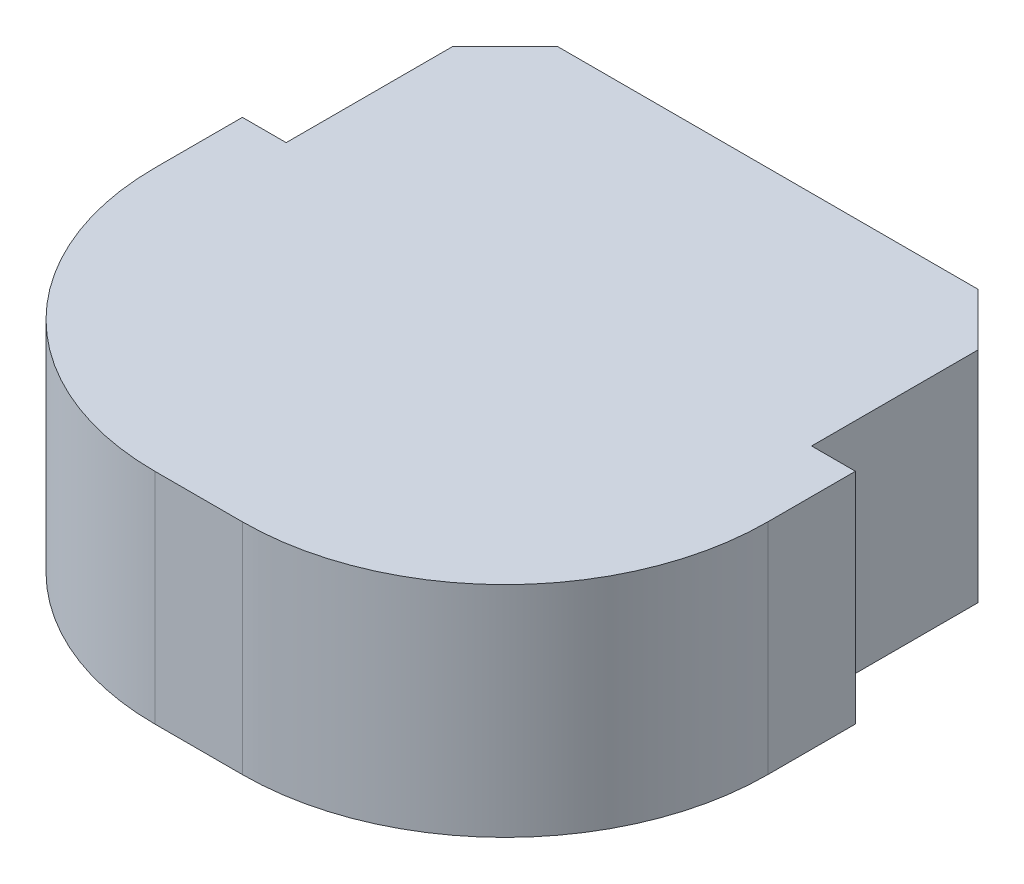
ISO-10303-21;
HEADER;
FILE_DESCRIPTION(('STEP AP214'),'2;1');
FILE_NAME('part.step','',(''),(''),'','','');
FILE_SCHEMA(('AUTOMOTIVE_DESIGN { 1 0 10303 214 1 1 1 1 }'));
ENDSEC;
DATA;
#1=APPLICATION_CONTEXT('core data for automotive mechanical design processes');
#2=APPLICATION_PROTOCOL_DEFINITION('international standard','automotive_design',2000,#1);
#3=PRODUCT_CONTEXT('',#1,'mechanical');
#4=PRODUCT('Part','Part','',(#3));
#5=PRODUCT_RELATED_PRODUCT_CATEGORY('part','',(#4));
#6=PRODUCT_DEFINITION_FORMATION('','',#4);
#7=PRODUCT_DEFINITION_CONTEXT('part definition',#1,'design');
#8=PRODUCT_DEFINITION('design','',#6,#7);
#9=PRODUCT_DEFINITION_SHAPE('','',#8);
#10=(LENGTH_UNIT() NAMED_UNIT(*) SI_UNIT(.MILLI.,.METRE.));
#11=(NAMED_UNIT(*) PLANE_ANGLE_UNIT() SI_UNIT($,.RADIAN.));
#12=(NAMED_UNIT(*) SI_UNIT($,.STERADIAN.) SOLID_ANGLE_UNIT());
#13=UNCERTAINTY_MEASURE_WITH_UNIT(LENGTH_MEASURE(1.E-05),#10,'distance_accuracy_value','');
#14=(GEOMETRIC_REPRESENTATION_CONTEXT(3) GLOBAL_UNCERTAINTY_ASSIGNED_CONTEXT((#13)) GLOBAL_UNIT_ASSIGNED_CONTEXT((#10,
#11,#12)) REPRESENTATION_CONTEXT('',''));
#15=CARTESIAN_POINT('',(0.,0.,0.));
#16=DIRECTION('',(0.,0.,1.));
#17=DIRECTION('',(1.,0.,0.));
#18=AXIS2_PLACEMENT_3D('',#15,#16,#17);
#19=CARTESIAN_POINT('',(-4.445,3.175,-2.54));
#20=DIRECTION('',(0.,0.,1.));
#21=DIRECTION('',(1.,0.,0.));
#22=AXIS2_PLACEMENT_3D('',#19,#20,#21);
#23=PLANE('',#22);
#24=DIRECTION('',(0.,1.,0.));
#25=VECTOR('',#24,1.);
#26=CARTESIAN_POINT('',(-3.81,3.175,-2.54));
#27=LINE('',#26,#25);
#28=CARTESIAN_POINT('',(-3.81,0.,-2.54));
#29=VERTEX_POINT('',#28);
#30=CARTESIAN_POINT('',(-3.81,3.175,-2.54));
#31=VERTEX_POINT('',#30);
#32=EDGE_CURVE('E168',#29,#31,#27,.T.);
#33=ORIENTED_EDGE('',*,*,#32,.F.);
#34=DIRECTION('',(-1.,0.,0.));
#35=VECTOR('',#34,1.);
#36=CARTESIAN_POINT('',(-4.445,0.,-2.54));
#37=LINE('',#36,#35);
#38=CARTESIAN_POINT('',(-4.445,0.,-2.54));
#39=VERTEX_POINT('',#38);
#40=EDGE_CURVE('E162',#29,#39,#37,.T.);
#41=ORIENTED_EDGE('',*,*,#40,.T.);
#42=DIRECTION('',(0.,-1.,0.));
#43=VECTOR('',#42,1.);
#44=CARTESIAN_POINT('',(-4.445,3.175,-2.54));
#45=LINE('',#44,#43);
#46=CARTESIAN_POINT('',(-4.445,3.175,-2.54));
#47=VERTEX_POINT('',#46);
#48=EDGE_CURVE('E201',#47,#39,#45,.T.);
#49=ORIENTED_EDGE('',*,*,#48,.F.);
#50=DIRECTION('',(-1.,0.,0.));
#51=VECTOR('',#50,1.);
#52=CARTESIAN_POINT('',(-4.445,3.175,-2.54));
#53=LINE('',#52,#51);
#54=EDGE_CURVE('E190',#31,#47,#53,.T.);
#55=ORIENTED_EDGE('',*,*,#54,.F.);
#56=EDGE_LOOP('',(#33,#41,#49,#55));
#57=FACE_BOUND('',#56,.T.);
#58=ADVANCED_FACE('F43',(#57),#23,.F.);
#59=DIRECTION('',(0.,-1.,0.));
#60=VECTOR('',#59,1.);
#61=CARTESIAN_POINT('',(3.81,3.175,-2.54));
#62=LINE('',#61,#60);
#63=CARTESIAN_POINT('',(3.81,3.175,-2.54));
#64=VERTEX_POINT('',#63);
#65=CARTESIAN_POINT('',(3.81,0.,-2.54));
#66=VERTEX_POINT('',#65);
#67=EDGE_CURVE('E156',#64,#66,#62,.T.);
#68=ORIENTED_EDGE('',*,*,#67,.F.);
#69=CARTESIAN_POINT('',(4.445,3.175,-2.54));
#70=VERTEX_POINT('',#69);
#71=EDGE_CURVE('E192',#70,#64,#53,.T.);
#72=ORIENTED_EDGE('',*,*,#71,.F.);
#73=DIRECTION('',(0.,-1.,0.));
#74=VECTOR('',#73,1.);
#75=CARTESIAN_POINT('',(4.445,3.175,-2.54));
#76=LINE('',#75,#74);
#77=CARTESIAN_POINT('',(4.445,0.,-2.54));
#78=VERTEX_POINT('',#77);
#79=EDGE_CURVE('E159',#70,#78,#76,.T.);
#80=ORIENTED_EDGE('',*,*,#79,.T.);
#81=EDGE_CURVE('E141',#78,#66,#37,.T.);
#82=ORIENTED_EDGE('',*,*,#81,.T.);
#83=EDGE_LOOP('',(#68,#72,#80,#82));
#84=FACE_BOUND('',#83,.T.);
#85=ADVANCED_FACE('F154',(#84),#23,.F.);
#86=CARTESIAN_POINT('',(4.445,3.175,-2.54));
#87=DIRECTION('',(-1.,0.,0.));
#88=DIRECTION('',(0.,0.,1.));
#89=AXIS2_PLACEMENT_3D('',#86,#87,#88);
#90=PLANE('',#89);
#91=DIRECTION('',(0.,0.,-1.));
#92=VECTOR('',#91,1.);
#93=CARTESIAN_POINT('',(4.445,3.175,-2.54));
#94=LINE('',#93,#92);
#95=CARTESIAN_POINT('',(4.445,3.175,-1.27));
#96=VERTEX_POINT('',#95);
#97=EDGE_CURVE('E187',#96,#70,#94,.T.);
#98=ORIENTED_EDGE('',*,*,#97,.F.);
#99=DIRECTION('',(0.,-1.,0.));
#100=VECTOR('',#99,1.);
#101=CARTESIAN_POINT('',(4.445,3.175,-1.27));
#102=LINE('',#101,#100);
#103=CARTESIAN_POINT('',(4.445,0.,-1.27));
#104=VERTEX_POINT('',#103);
#105=EDGE_CURVE('E11',#96,#104,#102,.T.);
#106=ORIENTED_EDGE('',*,*,#105,.T.);
#107=DIRECTION('',(0.,0.,-1.));
#108=VECTOR('',#107,1.);
#109=CARTESIAN_POINT('',(4.445,0.,-2.54));
#110=LINE('',#109,#108);
#111=EDGE_CURVE('E186',#104,#78,#110,.T.);
#112=ORIENTED_EDGE('',*,*,#111,.T.);
#113=ORIENTED_EDGE('',*,*,#79,.F.);
#114=EDGE_LOOP('',(#98,#106,#112,#113));
#115=FACE_BOUND('',#114,.T.);
#116=ADVANCED_FACE('F302',(#115),#90,.F.);
#117=CARTESIAN_POINT('',(-4.445,3.175,-2.54));
#118=DIRECTION('',(1.,0.,0.));
#119=DIRECTION('',(0.,0.,-1.));
#120=AXIS2_PLACEMENT_3D('',#117,#118,#119);
#121=PLANE('',#120);
#122=DIRECTION('',(0.,0.,1.));
#123=VECTOR('',#122,1.);
#124=CARTESIAN_POINT('',(-4.445,0.,-2.54));
#125=LINE('',#124,#123);
#126=CARTESIAN_POINT('',(-4.445,0.,-1.27));
#127=VERTEX_POINT('',#126);
#128=EDGE_CURVE('E161',#39,#127,#125,.T.);
#129=ORIENTED_EDGE('',*,*,#128,.T.);
#130=DIRECTION('',(0.,-1.,0.));
#131=VECTOR('',#130,1.);
#132=CARTESIAN_POINT('',(-4.445,3.175,-1.27));
#133=LINE('',#132,#131);
#134=CARTESIAN_POINT('',(-4.445,3.175,-1.27));
#135=VERTEX_POINT('',#134);
#136=EDGE_CURVE('E67',#127,#135,#133,.F.);
#137=ORIENTED_EDGE('',*,*,#136,.T.);
#138=DIRECTION('',(0.,0.,1.));
#139=VECTOR('',#138,1.);
#140=CARTESIAN_POINT('',(-4.445,3.175,-2.54));
#141=LINE('',#140,#139);
#142=EDGE_CURVE('E195',#47,#135,#141,.T.);
#143=ORIENTED_EDGE('',*,*,#142,.F.);
#144=ORIENTED_EDGE('',*,*,#48,.T.);
#145=EDGE_LOOP('',(#129,#137,#143,#144));
#146=FACE_BOUND('',#145,.T.);
#147=ADVANCED_FACE('F267',(#146),#121,.F.);
#148=CARTESIAN_POINT('',(-4.445,3.175,2.54));
#149=DIRECTION('',(0.,0.,-1.));
#150=DIRECTION('',(-1.,0.,0.));
#151=AXIS2_PLACEMENT_3D('',#148,#149,#150);
#152=PLANE('',#151);
#153=DIRECTION('',(1.,0.,0.));
#154=VECTOR('',#153,1.);
#155=CARTESIAN_POINT('',(-4.445,3.175,2.54));
#156=LINE('',#155,#154);
#157=CARTESIAN_POINT('',(-0.634999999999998,3.175,2.54));
#158=VERTEX_POINT('',#157);
#159=CARTESIAN_POINT('',(0.635000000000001,3.175,2.54));
#160=VERTEX_POINT('',#159);
#161=EDGE_CURVE('E198',#158,#160,#156,.T.);
#162=ORIENTED_EDGE('',*,*,#161,.F.);
#163=DIRECTION('',(0.,-1.,0.));
#164=VECTOR('',#163,1.);
#165=CARTESIAN_POINT('',(-0.634999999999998,3.175,2.54));
#166=LINE('',#165,#164);
#167=CARTESIAN_POINT('',(-0.634999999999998,0.,2.54));
#168=VERTEX_POINT('',#167);
#169=EDGE_CURVE('E242',#158,#168,#166,.T.);
#170=ORIENTED_EDGE('',*,*,#169,.T.);
#171=DIRECTION('',(1.,0.,0.));
#172=VECTOR('',#171,1.);
#173=CARTESIAN_POINT('',(-4.445,0.,2.54));
#174=LINE('',#173,#172);
#175=CARTESIAN_POINT('',(0.635000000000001,0.,2.54));
#176=VERTEX_POINT('',#175);
#177=EDGE_CURVE('E191',#168,#176,#174,.T.);
#178=ORIENTED_EDGE('',*,*,#177,.T.);
#179=DIRECTION('',(0.,-1.,0.));
#180=VECTOR('',#179,1.);
#181=CARTESIAN_POINT('',(0.635000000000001,3.175,2.54));
#182=LINE('',#181,#180);
#183=EDGE_CURVE('E239',#176,#160,#182,.F.);
#184=ORIENTED_EDGE('',*,*,#183,.T.);
#185=EDGE_LOOP('',(#162,#170,#178,#184));
#186=FACE_BOUND('',#185,.T.);
#187=ADVANCED_FACE('F262',(#186),#152,.F.);
#188=CARTESIAN_POINT('',(0.,3.175,0.));
#189=DIRECTION('',(0.,1.,0.));
#190=DIRECTION('',(0.,0.,1.));
#191=AXIS2_PLACEMENT_3D('',#188,#189,#190);
#192=PLANE('',#191);
#193=ORIENTED_EDGE('',*,*,#142,.T.);
#194=CARTESIAN_POINT('',(-0.634999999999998,3.175,-1.27));
#195=DIRECTION('',(0.,1.,0.));
#196=DIRECTION('',(0.,0.,1.));
#197=AXIS2_PLACEMENT_3D('',#194,#195,#196);
#198=CIRCLE('',#197,3.81);
#199=EDGE_CURVE('E52',#135,#158,#198,.T.);
#200=ORIENTED_EDGE('',*,*,#199,.T.);
#201=ORIENTED_EDGE('',*,*,#161,.T.);
#202=CARTESIAN_POINT('',(0.635000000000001,3.175,-1.27));
#203=DIRECTION('',(0.,1.,0.));
#204=DIRECTION('',(0.,0.,1.));
#205=AXIS2_PLACEMENT_3D('',#202,#203,#204);
#206=CIRCLE('',#205,3.81);
#207=EDGE_CURVE('E59',#160,#96,#206,.T.);
#208=ORIENTED_EDGE('',*,*,#207,.T.);
#209=ORIENTED_EDGE('',*,*,#97,.T.);
#210=ORIENTED_EDGE('',*,*,#71,.T.);
#211=DIRECTION('',(0.,0.,1.));
#212=VECTOR('',#211,1.);
#213=CARTESIAN_POINT('',(3.81,3.175,-5.715));
#214=LINE('',#213,#212);
#215=CARTESIAN_POINT('',(3.81,3.175,-4.953));
#216=VERTEX_POINT('',#215);
#217=EDGE_CURVE('E149',#216,#64,#214,.T.);
#218=ORIENTED_EDGE('',*,*,#217,.F.);
#219=DIRECTION('',(-0.707106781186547,0.,-0.707106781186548));
#220=VECTOR('',#219,1.);
#221=CARTESIAN_POINT('',(4.3815,3.175,-4.3815));
#222=LINE('',#221,#220);
#223=CARTESIAN_POINT('',(3.048,3.175,-5.715));
#224=VERTEX_POINT('',#223);
#225=EDGE_CURVE('E222',#216,#224,#222,.T.);
#226=ORIENTED_EDGE('',*,*,#225,.T.);
#227=DIRECTION('',(1.,0.,0.));
#228=VECTOR('',#227,1.);
#229=CARTESIAN_POINT('',(3.81,3.175,-5.715));
#230=LINE('',#229,#228);
#231=CARTESIAN_POINT('',(-3.048,3.175,-5.715));
#232=VERTEX_POINT('',#231);
#233=EDGE_CURVE('E167',#232,#224,#230,.T.);
#234=ORIENTED_EDGE('',*,*,#233,.F.);
#235=DIRECTION('',(-0.707106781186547,0.,0.707106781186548));
#236=VECTOR('',#235,1.);
#237=CARTESIAN_POINT('',(-4.3815,3.175,-4.38149999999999));
#238=LINE('',#237,#236);
#239=CARTESIAN_POINT('',(-3.81,3.175,-4.953));
#240=VERTEX_POINT('',#239);
#241=EDGE_CURVE('E225',#232,#240,#238,.T.);
#242=ORIENTED_EDGE('',*,*,#241,.T.);
#243=DIRECTION('',(0.,0.,1.));
#244=VECTOR('',#243,1.);
#245=CARTESIAN_POINT('',(-3.81,3.175,-5.715));
#246=LINE('',#245,#244);
#247=EDGE_CURVE('E183',#240,#31,#246,.T.);
#248=ORIENTED_EDGE('',*,*,#247,.T.);
#249=ORIENTED_EDGE('',*,*,#54,.T.);
#250=EDGE_LOOP('',(#193,#200,#201,#208,#209,#210,#218,#226,#234,#242,#248,#249));
#251=FACE_BOUND('',#250,.T.);
#252=ADVANCED_FACE('F258',(#251),#192,.T.);
#253=CARTESIAN_POINT('',(0.,0.,0.));
#254=DIRECTION('',(0.,1.,0.));
#255=DIRECTION('',(0.,0.,1.));
#256=AXIS2_PLACEMENT_3D('',#253,#254,#255);
#257=PLANE('',#256);
#258=ORIENTED_EDGE('',*,*,#177,.F.);
#259=CARTESIAN_POINT('',(-0.634999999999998,0.,-1.27));
#260=DIRECTION('',(0.,1.,0.));
#261=DIRECTION('',(0.,0.,1.));
#262=AXIS2_PLACEMENT_3D('',#259,#260,#261);
#263=CIRCLE('',#262,3.81);
#264=EDGE_CURVE('E249',#168,#127,#263,.F.);
#265=ORIENTED_EDGE('',*,*,#264,.T.);
#266=ORIENTED_EDGE('',*,*,#128,.F.);
#267=ORIENTED_EDGE('',*,*,#40,.F.);
#268=DIRECTION('',(0.,0.,1.));
#269=VECTOR('',#268,1.);
#270=CARTESIAN_POINT('',(-3.81,0.,-5.715));
#271=LINE('',#270,#269);
#272=CARTESIAN_POINT('',(-3.81,0.,-4.953));
#273=VERTEX_POINT('',#272);
#274=EDGE_CURVE('E150',#273,#29,#271,.T.);
#275=ORIENTED_EDGE('',*,*,#274,.F.);
#276=DIRECTION('',(0.707106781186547,0.,-0.707106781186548));
#277=VECTOR('',#276,1.);
#278=CARTESIAN_POINT('',(-3.048,0.,-5.715));
#279=LINE('',#278,#277);
#280=CARTESIAN_POINT('',(-3.048,0.,-5.715));
#281=VERTEX_POINT('',#280);
#282=EDGE_CURVE('E233',#273,#281,#279,.T.);
#283=ORIENTED_EDGE('',*,*,#282,.T.);
#284=DIRECTION('',(-1.,0.,0.));
#285=VECTOR('',#284,1.);
#286=CARTESIAN_POINT('',(3.81,0.,-5.715));
#287=LINE('',#286,#285);
#288=CARTESIAN_POINT('',(3.048,0.,-5.715));
#289=VERTEX_POINT('',#288);
#290=EDGE_CURVE('E173',#289,#281,#287,.T.);
#291=ORIENTED_EDGE('',*,*,#290,.F.);
#292=DIRECTION('',(0.707106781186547,0.,0.707106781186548));
#293=VECTOR('',#292,1.);
#294=CARTESIAN_POINT('',(3.048,0.,-5.715));
#295=LINE('',#294,#293);
#296=CARTESIAN_POINT('',(3.81,0.,-4.953));
#297=VERTEX_POINT('',#296);
#298=EDGE_CURVE('E144',#289,#297,#295,.T.);
#299=ORIENTED_EDGE('',*,*,#298,.T.);
#300=DIRECTION('',(0.,0.,1.));
#301=VECTOR('',#300,1.);
#302=CARTESIAN_POINT('',(3.81,0.,-5.715));
#303=LINE('',#302,#301);
#304=EDGE_CURVE('E136',#297,#66,#303,.T.);
#305=ORIENTED_EDGE('',*,*,#304,.T.);
#306=ORIENTED_EDGE('',*,*,#81,.F.);
#307=ORIENTED_EDGE('',*,*,#111,.F.);
#308=CARTESIAN_POINT('',(0.635000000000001,0.,-1.27));
#309=DIRECTION('',(0.,1.,0.));
#310=DIRECTION('',(0.,0.,1.));
#311=AXIS2_PLACEMENT_3D('',#308,#309,#310);
#312=CIRCLE('',#311,3.81);
#313=EDGE_CURVE('E246',#104,#176,#312,.F.);
#314=ORIENTED_EDGE('',*,*,#313,.T.);
#315=EDGE_LOOP('',(#258,#265,#266,#267,#275,#283,#291,#299,#305,#306,#307,#314));
#316=FACE_BOUND('',#315,.T.);
#317=ADVANCED_FACE('F139',(#316),#257,.F.);
#318=CARTESIAN_POINT('',(-3.81,3.175,-5.715));
#319=DIRECTION('',(1.,0.,0.));
#320=DIRECTION('',(0.,1.,0.));
#321=AXIS2_PLACEMENT_3D('',#318,#319,#320);
#322=PLANE('',#321);
#323=ORIENTED_EDGE('',*,*,#247,.F.);
#324=DIRECTION('',(0.,-1.,0.));
#325=VECTOR('',#324,1.);
#326=CARTESIAN_POINT('',(-3.81,0.,-4.953));
#327=LINE('',#326,#325);
#328=EDGE_CURVE('E228',#240,#273,#327,.T.);
#329=ORIENTED_EDGE('',*,*,#328,.T.);
#330=ORIENTED_EDGE('',*,*,#274,.T.);
#331=ORIENTED_EDGE('',*,*,#32,.T.);
#332=EDGE_LOOP('',(#323,#329,#330,#331));
#333=FACE_BOUND('',#332,.T.);
#334=ADVANCED_FACE('F287',(#333),#322,.F.);
#335=CARTESIAN_POINT('',(3.81,3.175,-5.715));
#336=DIRECTION('',(-1.,0.,0.));
#337=DIRECTION('',(0.,-1.,0.));
#338=AXIS2_PLACEMENT_3D('',#335,#336,#337);
#339=PLANE('',#338);
#340=ORIENTED_EDGE('',*,*,#304,.F.);
#341=DIRECTION('',(0.,1.,0.));
#342=VECTOR('',#341,1.);
#343=CARTESIAN_POINT('',(3.81,3.175,-4.953));
#344=LINE('',#343,#342);
#345=EDGE_CURVE('E236',#297,#216,#344,.T.);
#346=ORIENTED_EDGE('',*,*,#345,.T.);
#347=ORIENTED_EDGE('',*,*,#217,.T.);
#348=ORIENTED_EDGE('',*,*,#67,.T.);
#349=EDGE_LOOP('',(#340,#346,#347,#348));
#350=FACE_BOUND('',#349,.T.);
#351=ADVANCED_FACE('F164',(#350),#339,.F.);
#352=CARTESIAN_POINT('',(0.,0.,-5.715));
#353=DIRECTION('',(0.,0.,-1.));
#354=DIRECTION('',(-1.,0.,0.));
#355=AXIS2_PLACEMENT_3D('',#352,#353,#354);
#356=PLANE('',#355);
#357=ORIENTED_EDGE('',*,*,#290,.T.);
#358=DIRECTION('',(0.,1.,0.));
#359=VECTOR('',#358,1.);
#360=CARTESIAN_POINT('',(-3.048,3.175,-5.715));
#361=LINE('',#360,#359);
#362=EDGE_CURVE('E218',#281,#232,#361,.T.);
#363=ORIENTED_EDGE('',*,*,#362,.T.);
#364=ORIENTED_EDGE('',*,*,#233,.T.);
#365=DIRECTION('',(0.,-1.,0.));
#366=VECTOR('',#365,1.);
#367=CARTESIAN_POINT('',(3.048,0.,-5.715));
#368=LINE('',#367,#366);
#369=EDGE_CURVE('E214',#224,#289,#368,.T.);
#370=ORIENTED_EDGE('',*,*,#369,.T.);
#371=EDGE_LOOP('',(#357,#363,#364,#370));
#372=FACE_BOUND('',#371,.T.);
#373=ADVANCED_FACE('F278',(#372),#356,.T.);
#374=CARTESIAN_POINT('',(-3.048,0.,-5.715));
#375=DIRECTION('',(-0.707106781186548,0.,-0.707106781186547));
#376=DIRECTION('',(0.,-1.,0.));
#377=AXIS2_PLACEMENT_3D('',#374,#375,#376);
#378=PLANE('',#377);
#379=ORIENTED_EDGE('',*,*,#282,.F.);
#380=ORIENTED_EDGE('',*,*,#328,.F.);
#381=ORIENTED_EDGE('',*,*,#241,.F.);
#382=ORIENTED_EDGE('',*,*,#362,.F.);
#383=EDGE_LOOP('',(#379,#380,#381,#382));
#384=FACE_BOUND('',#383,.T.);
#385=ADVANCED_FACE('F283',(#384),#378,.T.);
#386=CARTESIAN_POINT('',(3.048,0.,-5.715));
#387=DIRECTION('',(0.707106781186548,0.,-0.707106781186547));
#388=DIRECTION('',(0.,1.,0.));
#389=AXIS2_PLACEMENT_3D('',#386,#387,#388);
#390=PLANE('',#389);
#391=ORIENTED_EDGE('',*,*,#225,.F.);
#392=ORIENTED_EDGE('',*,*,#345,.F.);
#393=ORIENTED_EDGE('',*,*,#298,.F.);
#394=ORIENTED_EDGE('',*,*,#369,.F.);
#395=EDGE_LOOP('',(#391,#392,#393,#394));
#396=FACE_BOUND('',#395,.T.);
#397=ADVANCED_FACE('F315',(#396),#390,.T.);
#398=CARTESIAN_POINT('',(-0.634999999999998,3.175,-1.27));
#399=DIRECTION('',(0.,-1.,0.));
#400=DIRECTION('',(0.,0.,-1.));
#401=AXIS2_PLACEMENT_3D('',#398,#399,#400);
#402=CYLINDRICAL_SURFACE('',#401,3.81);
#403=ORIENTED_EDGE('',*,*,#199,.F.);
#404=ORIENTED_EDGE('',*,*,#136,.F.);
#405=ORIENTED_EDGE('',*,*,#264,.F.);
#406=ORIENTED_EDGE('',*,*,#169,.F.);
#407=EDGE_LOOP('',(#403,#404,#405,#406));
#408=FACE_BOUND('',#407,.T.);
#409=ADVANCED_FACE('F264',(#408),#402,.T.);
#410=CARTESIAN_POINT('',(0.635000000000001,3.175,-1.27));
#411=DIRECTION('',(0.,-1.,0.));
#412=DIRECTION('',(0.,0.,-1.));
#413=AXIS2_PLACEMENT_3D('',#410,#411,#412);
#414=CYLINDRICAL_SURFACE('',#413,3.81);
#415=ORIENTED_EDGE('',*,*,#207,.F.);
#416=ORIENTED_EDGE('',*,*,#183,.F.);
#417=ORIENTED_EDGE('',*,*,#313,.F.);
#418=ORIENTED_EDGE('',*,*,#105,.F.);
#419=EDGE_LOOP('',(#415,#416,#417,#418));
#420=FACE_BOUND('',#419,.T.);
#421=ADVANCED_FACE('F45',(#420),#414,.T.);
#422=CLOSED_SHELL('',(#58,#85,#116,#147,#187,#252,#317,#334,#351,#373,#385,#397,#409,#421));
#423=MANIFOLD_SOLID_BREP('B2',#422);
#424=ADVANCED_BREP_SHAPE_REPRESENTATION('',(#18,#423),#14);
#425=SHAPE_DEFINITION_REPRESENTATION(#9,#424);
ENDSEC;
END-ISO-10303-21;
